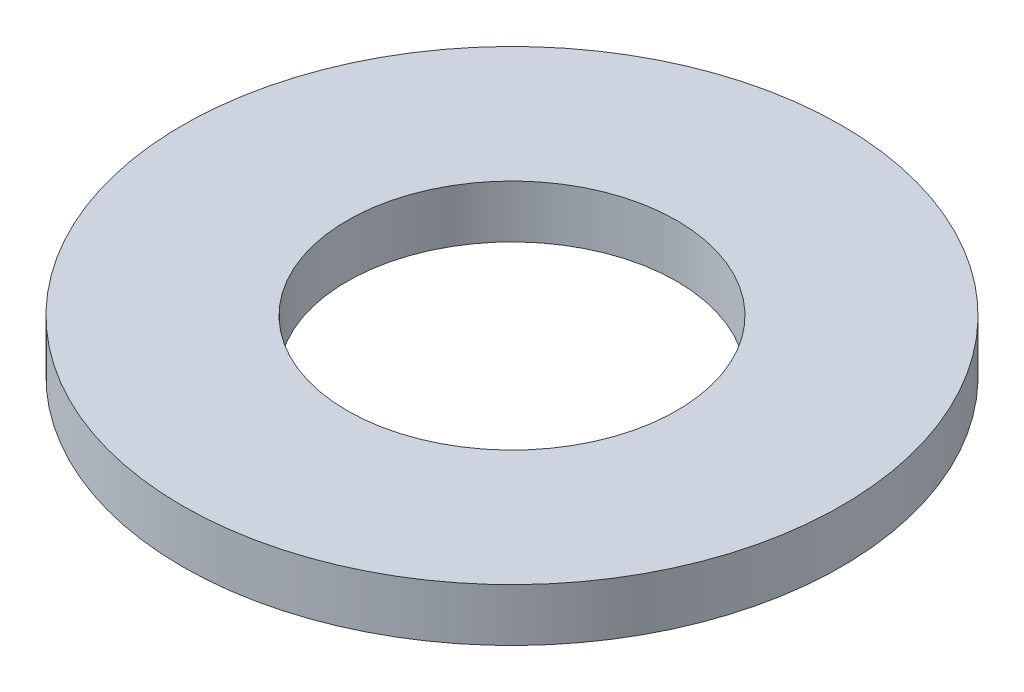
ISO-10303-21;
HEADER;
FILE_DESCRIPTION(('STEP AP214'),'2;1');
FILE_NAME('part.step','',(''),(''),'','','');
FILE_SCHEMA(('AUTOMOTIVE_DESIGN { 1 0 10303 214 1 1 1 1 }'));
ENDSEC;
DATA;
#1=APPLICATION_CONTEXT('core data for automotive mechanical design processes');
#2=APPLICATION_PROTOCOL_DEFINITION('international standard','automotive_design',2000,#1);
#3=PRODUCT_CONTEXT('',#1,'mechanical');
#4=PRODUCT('Part','Part','',(#3));
#5=PRODUCT_RELATED_PRODUCT_CATEGORY('part','',(#4));
#6=PRODUCT_DEFINITION_FORMATION('','',#4);
#7=PRODUCT_DEFINITION_CONTEXT('part definition',#1,'design');
#8=PRODUCT_DEFINITION('design','',#6,#7);
#9=PRODUCT_DEFINITION_SHAPE('','',#8);
#10=(LENGTH_UNIT() NAMED_UNIT(*) SI_UNIT(.MILLI.,.METRE.));
#11=(NAMED_UNIT(*) PLANE_ANGLE_UNIT() SI_UNIT($,.RADIAN.));
#12=(NAMED_UNIT(*) SI_UNIT($,.STERADIAN.) SOLID_ANGLE_UNIT());
#13=UNCERTAINTY_MEASURE_WITH_UNIT(LENGTH_MEASURE(1.E-05),#10,'distance_accuracy_value','');
#14=(GEOMETRIC_REPRESENTATION_CONTEXT(3) GLOBAL_UNCERTAINTY_ASSIGNED_CONTEXT((#13)) GLOBAL_UNIT_ASSIGNED_CONTEXT((#10,
#11,#12)) REPRESENTATION_CONTEXT('',''));
#15=CARTESIAN_POINT('',(0.,0.,0.));
#16=DIRECTION('',(0.,0.,1.));
#17=DIRECTION('',(1.,0.,0.));
#18=AXIS2_PLACEMENT_3D('',#15,#16,#17);
#19=CARTESIAN_POINT('',(0.,0.,0.));
#20=DIRECTION('',(0.,-1.,0.));
#21=DIRECTION('',(0.,0.,-1.));
#22=AXIS2_PLACEMENT_3D('',#19,#20,#21);
#23=CYLINDRICAL_SURFACE('',#22,25.);
#24=CARTESIAN_POINT('',(0.,4.,0.));
#25=DIRECTION('',(0.,-1.,0.));
#26=DIRECTION('',(0.,0.,-1.));
#27=AXIS2_PLACEMENT_3D('',#24,#25,#26);
#28=CIRCLE('',#27,25.);
#29=CARTESIAN_POINT('',(0.,4.,-25.));
#30=VERTEX_POINT('',#29);
#31=EDGE_CURVE('E10',#30,#30,#28,.T.);
#32=ORIENTED_EDGE('',*,*,#31,.T.);
#33=EDGE_LOOP('',(#32));
#34=FACE_BOUND('',#33,.T.);
#35=CARTESIAN_POINT('',(0.,0.,0.));
#36=DIRECTION('',(0.,-1.,0.));
#37=DIRECTION('',(0.,0.,-1.));
#38=AXIS2_PLACEMENT_3D('',#35,#36,#37);
#39=CIRCLE('',#38,25.);
#40=CARTESIAN_POINT('',(0.,0.,-25.));
#41=VERTEX_POINT('',#40);
#42=EDGE_CURVE('E45',#41,#41,#39,.T.);
#43=ORIENTED_EDGE('',*,*,#42,.F.);
#44=EDGE_LOOP('',(#43));
#45=FACE_BOUND('',#44,.T.);
#46=ADVANCED_FACE('F31',(#34,#45),#23,.T.);
#47=CARTESIAN_POINT('',(25.,4.,0.));
#48=DIRECTION('',(0.,1.,0.));
#49=DIRECTION('',(0.,0.,1.));
#50=AXIS2_PLACEMENT_3D('',#47,#48,#49);
#51=PLANE('',#50);
#52=CARTESIAN_POINT('',(0.,4.,0.));
#53=DIRECTION('',(0.,-1.,0.));
#54=DIRECTION('',(0.,0.,-1.));
#55=AXIS2_PLACEMENT_3D('',#52,#53,#54);
#56=CIRCLE('',#55,12.5);
#57=CARTESIAN_POINT('',(0.,4.,-12.5));
#58=VERTEX_POINT('',#57);
#59=EDGE_CURVE('E37',#58,#58,#56,.T.);
#60=ORIENTED_EDGE('',*,*,#59,.T.);
#61=EDGE_LOOP('',(#60));
#62=FACE_BOUND('',#61,.T.);
#63=ORIENTED_EDGE('',*,*,#31,.F.);
#64=EDGE_LOOP('',(#63));
#65=FACE_BOUND('',#64,.T.);
#66=ADVANCED_FACE('F55',(#62,#65),#51,.T.);
#67=CARTESIAN_POINT('',(0.,0.,0.));
#68=DIRECTION('',(0.,-1.,0.));
#69=DIRECTION('',(0.,0.,-1.));
#70=AXIS2_PLACEMENT_3D('',#67,#68,#69);
#71=CYLINDRICAL_SURFACE('',#70,12.5);
#72=CARTESIAN_POINT('',(0.,0.,0.));
#73=DIRECTION('',(0.,-1.,0.));
#74=DIRECTION('',(0.,0.,-1.));
#75=AXIS2_PLACEMENT_3D('',#72,#73,#74);
#76=CIRCLE('',#75,12.5);
#77=CARTESIAN_POINT('',(0.,0.,-12.5));
#78=VERTEX_POINT('',#77);
#79=EDGE_CURVE('E41',#78,#78,#76,.T.);
#80=ORIENTED_EDGE('',*,*,#79,.T.);
#81=EDGE_LOOP('',(#80));
#82=FACE_BOUND('',#81,.T.);
#83=ORIENTED_EDGE('',*,*,#59,.F.);
#84=EDGE_LOOP('',(#83));
#85=FACE_BOUND('',#84,.T.);
#86=ADVANCED_FACE('F59',(#82,#85),#71,.F.);
#87=CARTESIAN_POINT('',(12.5,0.,0.));
#88=DIRECTION('',(0.,-1.,0.));
#89=DIRECTION('',(0.,0.,-1.));
#90=AXIS2_PLACEMENT_3D('',#87,#88,#89);
#91=PLANE('',#90);
#92=ORIENTED_EDGE('',*,*,#42,.T.);
#93=EDGE_LOOP('',(#92));
#94=FACE_BOUND('',#93,.T.);
#95=ORIENTED_EDGE('',*,*,#79,.F.);
#96=EDGE_LOOP('',(#95));
#97=FACE_BOUND('',#96,.T.);
#98=ADVANCED_FACE('F51',(#94,#97),#91,.T.);
#99=CLOSED_SHELL('',(#46,#66,#86,#98));
#100=MANIFOLD_SOLID_BREP('B2',#99);
#101=ADVANCED_BREP_SHAPE_REPRESENTATION('',(#18,#100),#14);
#102=SHAPE_DEFINITION_REPRESENTATION(#9,#101);
ENDSEC;
END-ISO-10303-21;
